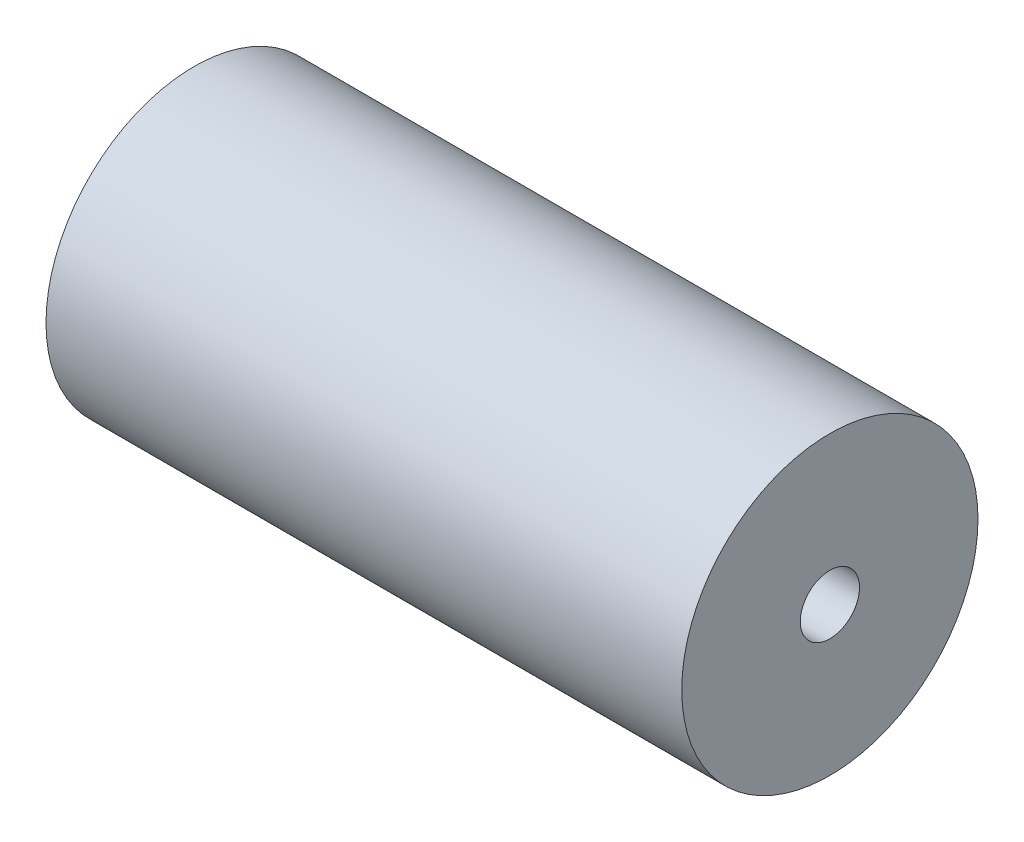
from build123d import *

# Parameters (mm, degrees)
SKETCH1_R           = 25
SKETCH1_R_2         = 5
BOSS_EXTRUDE1_DEPTH = 107.3


with BuildPart() as part:
    # Sketch1 → Boss-Extrude1 (new body)
    with BuildSketch(Plane(origin=(0, 0, 0), x_dir=(0, 0, -1), z_dir=(1, 0, 0))):
        Circle(SKETCH1_R)
        Circle(SKETCH1_R_2, mode=Mode.SUBTRACT)
    extrude(amount=BOSS_EXTRUDE1_DEPTH)


solid = part.part
